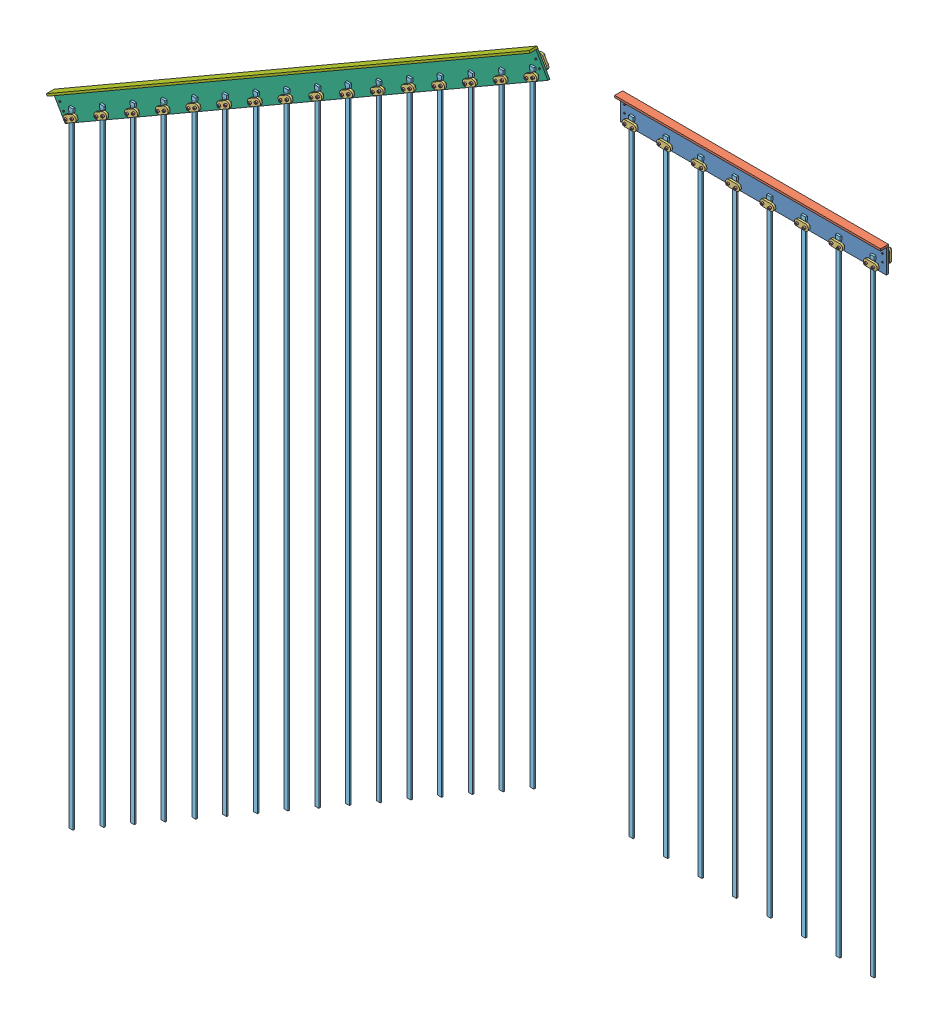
SolidWorks assembly Assem2.sldasm, configuration Default (file format 9000). Lengths in mm.
Overall size (2665.99 2913.15 49.43).
118 component instances, 7 part files, 0 mates.
Components (placement in the parent):
- fs-bs-right-mount-assembly-with-led-strips-1: fs-bs-right-mount-assembly-with-led-strips.SLDASM [Default] at origin size (850.9 2044.33 45.12)
  - fs-bs-right-mount-assembly-with-screws-1: fs-bs-right-mount-assembly-with-screws.SLDASM [Default] at origin size (850.9 82.55 45.12)
    - fs-bs-right-mount-assembly-1: fs-bs-right-mount-assembly.SLDASM [Default] at origin size (850.9 82.55 38.15)
      - fs-bs-right-mount-vertical-component-1: fs-bs-right-mount-vertical-component.SLDPRT [Default] at origin size (850.9 76.2 6.35)
      - fs-bs-right-mount-horizontal-component-1: fs-bs-right-mount-horizontal-component.SLDPRT [Default] at (425.45 76.2 12.7) size (850.9 6.35 25.4)
      - fs-clamp-1: fs-clamp.SLDPRT [Default] at (27.94 15.24 12.7326) size (44.45 20.32 6.35)
      - fs-clamp-11: fs-clamp.SLDPRT [Default] at (12.7 29.845 -12.7409) x (0 1 0) z (0 0 1) size (44.45 20.32 6.35)
      - fs-clamp-12: fs-clamp.SLDPRT [Default] at (838.2 29.845 -6.3972) x (0 1 0) z (0 0 -1) size (44.45 20.32 6.35)
      - fs-clamp-4: fs-clamp.SLDPRT [Default] at (138.176 15.24 12.7326) size (44.45 20.32 6.35)
      - fs-clamp-5: fs-clamp.SLDPRT [Default] at (248.412 15.24 12.7326) size (44.45 20.32 6.35)
      - fs-clamp-6: fs-clamp.SLDPRT [Default] at (358.648 15.24 12.7326) size (44.45 20.32 6.35)
      - fs-clamp-7: fs-clamp.SLDPRT [Default] at (468.884 15.24 12.7326) size (44.45 20.32 6.35)
      - fs-clamp-8: fs-clamp.SLDPRT [Default] at (579.12 15.24 12.7326) size (44.45 20.32 6.35)
      - fs-clamp-9: fs-clamp.SLDPRT [Default] at (689.356 15.24 12.7326) size (44.45 20.32 6.35)
      - fs-clamp-10: fs-clamp.SLDPRT [Default] at (799.592 15.24 12.7326) size (44.45 20.32 6.35)
    - socket head cap screw_ai-1: socket head cap screw_ai.sldprt [HX-SHCS 0.19-32x0.875x0.875-N] at (52.07 15.24 25.3347) x (0 0 -1) z (0.61191 -0.790927 0) size (27.05 7.94 7.94)
    - socket head cap screw_ai-2: socket head cap screw_ai.sldprt [HX-SHCS 0.19-32x0.875x0.875-N] at (12.7 29.845 -19.6757) x (0 0 1) z (-0.841681 -0.539975 0) size (27.05 7.94 7.94)
    - socket head cap screw_ai-3: socket head cap screw_ai.sldprt [HX-SHCS 0.19-32x0.875x0.875-N] at (12.7 53.975 -19.387) x (0 0 1) z (0.231262 0.972891 0) size (27.05 7.94 7.94)
    - socket head cap screw_ai-4: socket head cap screw_ai.sldprt [HX-SHCS 0.19-32x0.875x0.875-N] at (838.2 29.845 -19.7235) x (0 0 1) z (-0.178736 -0.983897 0) size (27.05 7.94 7.94)
    - socket head cap screw_ai-5: socket head cap screw_ai.sldprt [HX-SHCS 0.19-32x0.875x0.875-N] at (838.2 53.975 -19.4006) x (0 0 1) z (-0.954871 -0.29702 0) size (27.05 7.94 7.94)
    - socket head cap screw_ai-6: socket head cap screw_ai.sldprt [HX-SHCS 0.19-32x0.875x0.875-N] at (27.94 15.24 25.0524) x (0 0 -1) z (-0.570283 0.821448 0) size (27.05 7.94 7.94)
    - socket head cap screw_ai-7: socket head cap screw_ai.sldprt [HX-SHCS 0.19-32x0.875x0.875-N] at (138.176 15.24 25.0524) x (0 0 -1) z (-0.570283 0.821448 0) size (27.05 7.94 7.94)
    - socket head cap screw_ai-8: socket head cap screw_ai.sldprt [HX-SHCS 0.19-32x0.875x0.875-N] at (248.412 15.24 25.0524) x (0 0 -1) z (-0.570283 0.821448 0) size (27.05 7.94 7.94)
    - socket head cap screw_ai-9: socket head cap screw_ai.sldprt [HX-SHCS 0.19-32x0.875x0.875-N] at (358.648 15.24 25.0524) x (0 0 -1) z (-0.570283 0.821448 0) size (27.05 7.94 7.94)
    - socket head cap screw_ai-10: socket head cap screw_ai.sldprt [HX-SHCS 0.19-32x0.875x0.875-N] at (468.884 15.24 25.0524) x (0 0 -1) z (-0.570283 0.821448 0) size (27.05 7.94 7.94)
    - socket head cap screw_ai-11: socket head cap screw_ai.sldprt [HX-SHCS 0.19-32x0.875x0.875-N] at (579.12 15.24 25.0524) x (0 0 -1) z (-0.570283 0.821448 0) size (27.05 7.94 7.94)
    - socket head cap screw_ai-12: socket head cap screw_ai.sldprt [HX-SHCS 0.19-32x0.875x0.875-N] at (689.356 15.24 25.0524) x (0 0 -1) z (-0.570283 0.821448 0) size (27.05 7.94 7.94)
    - socket head cap screw_ai-13: socket head cap screw_ai.sldprt [HX-SHCS 0.19-32x0.875x0.875-N] at (799.592 15.24 25.0524) x (0 0 -1) z (-0.570283 0.821448 0) size (27.05 7.94 7.94)
    - socket head cap screw_ai-14: socket head cap screw_ai.sldprt [HX-SHCS 0.19-32x0.875x0.875-N] at (162.306 15.24 25.3347) x (0 0 -1) z (0.61191 -0.790927 0) size (27.05 7.94 7.94)
    - socket head cap screw_ai-15: socket head cap screw_ai.sldprt [HX-SHCS 0.19-32x0.875x0.875-N] at (272.542 15.24 25.3347) x (0 0 -1) z (0.61191 -0.790927 0) size (27.05 7.94 7.94)
    - socket head cap screw_ai-16: socket head cap screw_ai.sldprt [HX-SHCS 0.19-32x0.875x0.875-N] at (382.778 15.24 25.3347) x (0 0 -1) z (0.61191 -0.790927 0) size (27.05 7.94 7.94)
    - socket head cap screw_ai-17: socket head cap screw_ai.sldprt [HX-SHCS 0.19-32x0.875x0.875-N] at (493.014 15.24 25.3347) x (0 0 -1) z (0.61191 -0.790927 0) size (27.05 7.94 7.94)
    - socket head cap screw_ai-18: socket head cap screw_ai.sldprt [HX-SHCS 0.19-32x0.875x0.875-N] at (603.25 15.24 25.3347) x (0 0 -1) z (0.61191 -0.790927 0) size (27.05 7.94 7.94)
    - socket head cap screw_ai-19: socket head cap screw_ai.sldprt [HX-SHCS 0.19-32x0.875x0.875-N] at (713.486 15.24 25.3347) x (0 0 -1) z (0.61191 -0.790927 0) size (27.05 7.94 7.94)
    - socket head cap screw_ai-20: socket head cap screw_ai.sldprt [HX-SHCS 0.19-32x0.875x0.875-N] at (823.722 15.24 25.3347) x (0 0 -1) z (0.61191 -0.790927 0) size (27.05 7.94 7.94)
  - fs-led-strip-1: fs-led-strip.SLDPRT [Default] at (39.8281 32.6608 10.0075) size (14.29 2000 6.35)
  - fs-led-strip-2: fs-led-strip.SLDPRT [Default] at (150.0641 32.6608 10.0075) size (14.29 2000 6.35)
  - fs-led-strip-3: fs-led-strip.SLDPRT [Default] at (260.3001 32.6608 10.0075) size (14.29 2000 6.35)
  - fs-led-strip-4: fs-led-strip.SLDPRT [Default] at (370.5361 32.6608 10.0075) size (14.29 2000 6.35)
  - fs-led-strip-5: fs-led-strip.SLDPRT [Default] at (480.7721 32.6608 10.0075) size (14.29 2000 6.35)
  - fs-led-strip-6: fs-led-strip.SLDPRT [Default] at (591.0081 32.6608 10.0075) size (14.29 2000 6.35)
  - fs-led-strip-7: fs-led-strip.SLDPRT [Default] at (701.2441 32.6608 10.0075) size (14.29 2000 6.35)
  - fs-led-strip-8: fs-led-strip.SLDPRT [Default] at (811.4801 32.6608 10.0075) size (14.29 2000 6.35)
- fs-bs-angled-mount-assembly-with-led-strips-1: fs-bs-angled-mount-assembly-with-led-strips.SLDASM [Default] at (-1748.9685 -836.1518 14.1159) size (1586.57 2904.55 44.16)
  - fs-led-strip-1: fs-led-strip.SLDPRT [Default] at origin size (14.29 2000 6.35)
  - fs-bs-angled-mount-assembly-with-screws-1: fs-bs-angled-mount-assembly-with-screws.SLDASM [Default] at (-24.8458 -53.5614 -9.8077) x (0.866025 0.5 0) z (0 0 1) size (1784.35 82.55 44.16)
    - fs-bs-angled-mount-assembly-1: fs-bs-angled-mount-assembly.SLDASM [Default] at origin size (1784.35 82.55 38)
      - fs-bs-angled-mount-vertical-component-1: fs-bs-angled-mount-vertical-component.SLDPRT [Default] at origin size (1784.35 76.2 6.35)
      - fs-bs-angled-mount-horizontal-component-1: fs-bs-angled-mount-horizontal-component.SLDPRT [Default] at (892.175 76.2 12.7) size (1784.35 6.35 25.4)
      - fs-clamp-1: fs-clamp.SLDPRT [Default] at (27.94 15.24 12.8007) size (44.45 20.32 6.35)
      - fs-clamp-2: fs-clamp.SLDPRT [Default] at (141.478 15.24 12.8007) size (44.45 20.32 6.35)
      - fs-clamp-3: fs-clamp.SLDPRT [Default] at (255.016 15.24 12.8007) size (44.45 20.32 6.35)
      - fs-clamp-4: fs-clamp.SLDPRT [Default] at (368.554 15.24 12.8007) size (44.45 20.32 6.35)
      - fs-clamp-5: fs-clamp.SLDPRT [Default] at (482.092 15.24 12.8007) size (44.45 20.32 6.35)
      - fs-clamp-6: fs-clamp.SLDPRT [Default] at (595.63 15.24 12.8007) size (44.45 20.32 6.35)
      - fs-clamp-7: fs-clamp.SLDPRT [Default] at (709.168 15.24 12.8007) size (44.45 20.32 6.35)
      - fs-clamp-8: fs-clamp.SLDPRT [Default] at (822.706 15.24 12.8007) size (44.45 20.32 6.35)
      - fs-clamp-9: fs-clamp.SLDPRT [Default] at (936.244 15.24 12.8007) size (44.45 20.32 6.35)
      - fs-clamp-10: fs-clamp.SLDPRT [Default] at (1049.782 15.24 12.8007) size (44.45 20.32 6.35)
      - fs-clamp-11: fs-clamp.SLDPRT [Default] at (1163.32 15.24 12.8007) size (44.45 20.32 6.35)
      - fs-clamp-12: fs-clamp.SLDPRT [Default] at (1276.858 15.24 12.8007) size (44.45 20.32 6.35)
      - fs-clamp-13: fs-clamp.SLDPRT [Default] at (1390.396 15.24 12.8007) size (44.45 20.32 6.35)
      - fs-clamp-14: fs-clamp.SLDPRT [Default] at (1503.934 15.24 12.8007) size (44.45 20.32 6.35)
      - fs-clamp-15: fs-clamp.SLDPRT [Default] at (1617.472 15.24 12.8007) size (44.45 20.32 6.35)
      - fs-clamp-16: fs-clamp.SLDPRT [Default] at (1731.01 15.24 12.8007) size (44.45 20.32 6.35)
      - fs-clamp-19: fs-clamp.SLDPRT [Default] at (12.7 53.975 -12.5735) x (0 -1 0) z (0 0 1) size (44.45 20.32 6.35)
      - fs-clamp-20: fs-clamp.SLDPRT [Default] at (1771.65 29.845 -12.5985) x (0 1 0) z (0 0 1) size (44.45 20.32 6.35)
    - socket head cap screw_ai-1: socket head cap screw_ai.sldprt [HX-SHCS 0.19-32x0.875x0.875-N] at (27.94 15.24 25.0524) x (0 0 -1) z (-0.570283 0.821448 0) size (27.05 7.94 7.94)
    - socket head cap screw_ai-3: socket head cap screw_ai.sldprt [HX-SHCS 0.19-32x0.875x0.875-N] at (52.07 15.24 25.3347) x (0 0 -1) z (0.61191 -0.790927 0) size (27.05 7.94 7.94)
    - socket head cap screw_ai-4: socket head cap screw_ai.sldprt [HX-SHCS 0.19-32x0.875x0.875-N] at (12.7 29.845 -18.7638) x (0 0 1) z (-0.601781 -0.798661 0) size (27.05 7.94 7.94)
    - socket head cap screw_ai-5: socket head cap screw_ai.sldprt [HX-SHCS 0.19-32x0.875x0.875-N] at (12.7 53.975 -18.6513) x (0 0 1) z (0.101721 0.994813 0) size (27.05 7.94 7.94)
    - socket head cap screw_ai-6: socket head cap screw_ai.sldprt [HX-SHCS 0.19-32x0.875x0.875-N] at (1771.65 29.845 -18.7537) x (0 0 1) z (-0.220834 -0.975311 0) size (27.05 7.94 7.94)
    - socket head cap screw_ai-7: socket head cap screw_ai.sldprt [HX-SHCS 0.19-32x0.875x0.875-N] at (1771.65 53.975 -18.662) x (0 0 1) z (-0.85708 -0.515183 0) size (27.05 7.94 7.94)
    - socket head cap screw_ai-8: socket head cap screw_ai.sldprt [HX-SHCS 0.19-32x0.875x0.875-N] at (141.478 15.24 25.0524) x (0 0 -1) z (-0.570283 0.821448 0) size (27.05 7.94 7.94)
    - socket head cap screw_ai-9: socket head cap screw_ai.sldprt [HX-SHCS 0.19-32x0.875x0.875-N] at (255.016 15.24 25.0524) x (0 0 -1) z (-0.570283 0.821448 0) size (27.05 7.94 7.94)
    - socket head cap screw_ai-10: socket head cap screw_ai.sldprt [HX-SHCS 0.19-32x0.875x0.875-N] at (368.554 15.24 25.0524) x (0 0 -1) z (-0.570283 0.821448 0) size (27.05 7.94 7.94)
    - socket head cap screw_ai-11: socket head cap screw_ai.sldprt [HX-SHCS 0.19-32x0.875x0.875-N] at (482.092 15.24 25.0524) x (0 0 -1) z (-0.570283 0.821448 0) size (27.05 7.94 7.94)
    - socket head cap screw_ai-12: socket head cap screw_ai.sldprt [HX-SHCS 0.19-32x0.875x0.875-N] at (595.63 15.24 25.0524) x (0 0 -1) z (-0.570283 0.821448 0) size (27.05 7.94 7.94)
    - socket head cap screw_ai-13: socket head cap screw_ai.sldprt [HX-SHCS 0.19-32x0.875x0.875-N] at (709.168 15.24 25.0524) x (0 0 -1) z (-0.570283 0.821448 0) size (27.05 7.94 7.94)
    - socket head cap screw_ai-14: socket head cap screw_ai.sldprt [HX-SHCS 0.19-32x0.875x0.875-N] at (822.706 15.24 25.0524) x (0 0 -1) z (-0.570283 0.821448 0) size (27.05 7.94 7.94)
    - socket head cap screw_ai-15: socket head cap screw_ai.sldprt [HX-SHCS 0.19-32x0.875x0.875-N] at (936.244 15.24 25.0524) x (0 0 -1) z (-0.570283 0.821448 0) size (27.05 7.94 7.94)
    - socket head cap screw_ai-16: socket head cap screw_ai.sldprt [HX-SHCS 0.19-32x0.875x0.875-N] at (1049.782 15.24 25.0524) x (0 0 -1) z (-0.570283 0.821448 0) size (27.05 7.94 7.94)
    - socket head cap screw_ai-17: socket head cap screw_ai.sldprt [HX-SHCS 0.19-32x0.875x0.875-N] at (1163.32 15.24 25.0524) x (0 0 -1) z (-0.570283 0.821448 0) size (27.05 7.94 7.94)
    - socket head cap screw_ai-18: socket head cap screw_ai.sldprt [HX-SHCS 0.19-32x0.875x0.875-N] at (1276.858 15.24 25.0524) x (0 0 -1) z (-0.570283 0.821448 0) size (27.05 7.94 7.94)
    - socket head cap screw_ai-19: socket head cap screw_ai.sldprt [HX-SHCS 0.19-32x0.875x0.875-N] at (1390.396 15.24 25.0524) x (0 0 -1) z (-0.570283 0.821448 0) size (27.05 7.94 7.94)
    - socket head cap screw_ai-20: socket head cap screw_ai.sldprt [HX-SHCS 0.19-32x0.875x0.875-N] at (1503.934 15.24 25.0524) x (0 0 -1) z (-0.570283 0.821448 0) size (27.05 7.94 7.94)
    - socket head cap screw_ai-21: socket head cap screw_ai.sldprt [HX-SHCS 0.19-32x0.875x0.875-N] at (1617.472 15.24 25.0524) x (0 0 -1) z (-0.570283 0.821448 0) size (27.05 7.94 7.94)
    - socket head cap screw_ai-22: socket head cap screw_ai.sldprt [HX-SHCS 0.19-32x0.875x0.875-N] at (1731.01 15.24 25.0524) x (0 0 -1) z (-0.570283 0.821448 0) size (27.05 7.94 7.94)
    - socket head cap screw_ai-25: socket head cap screw_ai.sldprt [HX-SHCS 0.19-32x0.875x0.875-N] at (165.608 15.24 25.3347) x (0 0 -1) z (0.61191 -0.790927 0) size (27.05 7.94 7.94)
    - socket head cap screw_ai-26: socket head cap screw_ai.sldprt [HX-SHCS 0.19-32x0.875x0.875-N] at (279.146 15.24 25.3347) x (0 0 -1) z (0.61191 -0.790927 0) size (27.05 7.94 7.94)
    - socket head cap screw_ai-27: socket head cap screw_ai.sldprt [HX-SHCS 0.19-32x0.875x0.875-N] at (392.684 15.24 25.3347) x (0 0 -1) z (0.61191 -0.790927 0) size (27.05 7.94 7.94)
    - socket head cap screw_ai-28: socket head cap screw_ai.sldprt [HX-SHCS 0.19-32x0.875x0.875-N] at (506.222 15.24 25.3347) x (0 0 -1) z (0.61191 -0.790927 0) size (27.05 7.94 7.94)
    - socket head cap screw_ai-29: socket head cap screw_ai.sldprt [HX-SHCS 0.19-32x0.875x0.875-N] at (619.76 15.24 25.3347) x (0 0 -1) z (0.61191 -0.790927 0) size (27.05 7.94 7.94)
    - socket head cap screw_ai-30: socket head cap screw_ai.sldprt [HX-SHCS 0.19-32x0.875x0.875-N] at (733.298 15.24 25.3347) x (0 0 -1) z (0.61191 -0.790927 0) size (27.05 7.94 7.94)
    - socket head cap screw_ai-31: socket head cap screw_ai.sldprt [HX-SHCS 0.19-32x0.875x0.875-N] at (846.836 15.24 25.3347) x (0 0 -1) z (0.61191 -0.790927 0) size (27.05 7.94 7.94)
    - socket head cap screw_ai-32: socket head cap screw_ai.sldprt [HX-SHCS 0.19-32x0.875x0.875-N] at (960.374 15.24 25.3347) x (0 0 -1) z (0.61191 -0.790927 0) size (27.05 7.94 7.94)
    - socket head cap screw_ai-33: socket head cap screw_ai.sldprt [HX-SHCS 0.19-32x0.875x0.875-N] at (1073.912 15.24 25.3347) x (0 0 -1) z (0.61191 -0.790927 0) size (27.05 7.94 7.94)
    - socket head cap screw_ai-34: socket head cap screw_ai.sldprt [HX-SHCS 0.19-32x0.875x0.875-N] at (1187.45 15.24 25.3347) x (0 0 -1) z (0.61191 -0.790927 0) size (27.05 7.94 7.94)
    - socket head cap screw_ai-35: socket head cap screw_ai.sldprt [HX-SHCS 0.19-32x0.875x0.875-N] at (1300.988 15.24 25.3347) x (0 0 -1) z (0.61191 -0.790927 0) size (27.05 7.94 7.94)
    - socket head cap screw_ai-36: socket head cap screw_ai.sldprt [HX-SHCS 0.19-32x0.875x0.875-N] at (1414.526 15.24 25.3347) x (0 0 -1) z (0.61191 -0.790927 0) size (27.05 7.94 7.94)
    - socket head cap screw_ai-37: socket head cap screw_ai.sldprt [HX-SHCS 0.19-32x0.875x0.875-N] at (1528.064 15.24 25.3347) x (0 0 -1) z (0.61191 -0.790927 0) size (27.05 7.94 7.94)
    - socket head cap screw_ai-38: socket head cap screw_ai.sldprt [HX-SHCS 0.19-32x0.875x0.875-N] at (1641.602 15.24 25.3347) x (0 0 -1) z (0.61191 -0.790927 0) size (27.05 7.94 7.94)
    - socket head cap screw_ai-39: socket head cap screw_ai.sldprt [HX-SHCS 0.19-32x0.875x0.875-N] at (1755.14 15.24 25.3347) x (0 0 -1) z (0.61191 -0.790927 0) size (27.05 7.94 7.94)
  - fs-led-strip-2: fs-led-strip.SLDPRT [Default] at (98.3268 56.769 0) size (14.29 2000 6.35)
  - fs-led-strip-3: fs-led-strip.SLDPRT [Default] at (196.6536 113.538 0) size (14.29 2000 6.35)
  - fs-led-strip-4: fs-led-strip.SLDPRT [Default] at (294.9804 170.307 0) size (14.29 2000 6.35)
  - fs-led-strip-5: fs-led-strip.SLDPRT [Default] at (393.3072 227.076 0) size (14.29 2000 6.35)
  - fs-led-strip-6: fs-led-strip.SLDPRT [Default] at (491.634 283.845 0) size (14.29 2000 6.35)
  - fs-led-strip-7: fs-led-strip.SLDPRT [Default] at (589.9608 340.614 0) size (14.29 2000 6.35)
  - fs-led-strip-8: fs-led-strip.SLDPRT [Default] at (688.2875 397.383 0) size (14.29 2000 6.35)
  - fs-led-strip-9: fs-led-strip.SLDPRT [Default] at (786.6143 454.152 0) size (14.29 2000 6.35)
  - fs-led-strip-10: fs-led-strip.SLDPRT [Default] at (884.9411 510.921 0) size (14.29 2000 6.35)
  - fs-led-strip-11: fs-led-strip.SLDPRT [Default] at (983.2679 567.69 0) size (14.29 2000 6.35)
  - fs-led-strip-12: fs-led-strip.SLDPRT [Default] at (1081.5947 624.459 0) size (14.29 2000 6.35)
  - fs-led-strip-13: fs-led-strip.SLDPRT [Default] at (1179.9215 681.228 0) size (14.29 2000 6.35)
  - fs-led-strip-14: fs-led-strip.SLDPRT [Default] at (1278.2483 737.997 0) size (14.29 2000 6.35)
  - fs-led-strip-15: fs-led-strip.SLDPRT [Default] at (1376.5751 794.766 0) size (14.29 2000 6.35)
  - fs-led-strip-16: fs-led-strip.SLDPRT [Default] at (1474.9019 851.535 0) size (14.29 2000 6.35)
